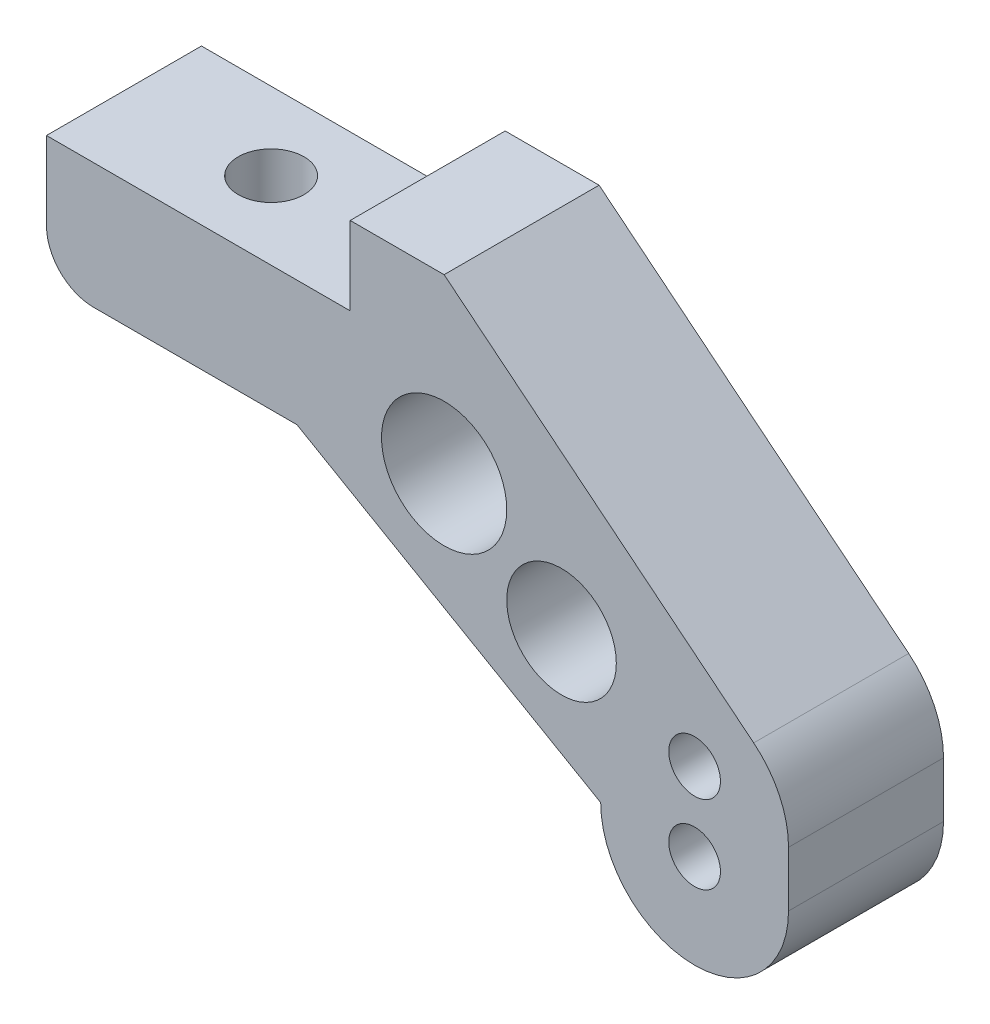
ISO-10303-21;
HEADER;
FILE_DESCRIPTION(('STEP AP214'),'2;1');
FILE_NAME('part.step','',(''),(''),'','','');
FILE_SCHEMA(('AUTOMOTIVE_DESIGN { 1 0 10303 214 1 1 1 1 }'));
ENDSEC;
DATA;
#1=APPLICATION_CONTEXT('core data for automotive mechanical design processes');
#2=APPLICATION_PROTOCOL_DEFINITION('international standard','automotive_design',2000,#1);
#3=PRODUCT_CONTEXT('',#1,'mechanical');
#4=PRODUCT('Part','Part','',(#3));
#5=PRODUCT_RELATED_PRODUCT_CATEGORY('part','',(#4));
#6=PRODUCT_DEFINITION_FORMATION('','',#4);
#7=PRODUCT_DEFINITION_CONTEXT('part definition',#1,'design');
#8=PRODUCT_DEFINITION('design','',#6,#7);
#9=PRODUCT_DEFINITION_SHAPE('','',#8);
#10=(LENGTH_UNIT() NAMED_UNIT(*) SI_UNIT(.MILLI.,.METRE.));
#11=(NAMED_UNIT(*) PLANE_ANGLE_UNIT() SI_UNIT($,.RADIAN.));
#12=(NAMED_UNIT(*) SI_UNIT($,.STERADIAN.) SOLID_ANGLE_UNIT());
#13=UNCERTAINTY_MEASURE_WITH_UNIT(LENGTH_MEASURE(1.E-05),#10,'distance_accuracy_value','');
#14=(GEOMETRIC_REPRESENTATION_CONTEXT(3) GLOBAL_UNCERTAINTY_ASSIGNED_CONTEXT((#13)) GLOBAL_UNIT_ASSIGNED_CONTEXT((#10,
#11,#12)) REPRESENTATION_CONTEXT('',''));
#15=CARTESIAN_POINT('',(0.,0.,0.));
#16=DIRECTION('',(0.,0.,1.));
#17=DIRECTION('',(1.,0.,0.));
#18=AXIS2_PLACEMENT_3D('',#15,#16,#17);
#19=CARTESIAN_POINT('',(-10.,0.,0.));
#20=DIRECTION('',(0.,1.,0.));
#21=DIRECTION('',(0.,0.,1.));
#22=AXIS2_PLACEMENT_3D('',#19,#20,#21);
#23=CYLINDRICAL_SURFACE('',#22,2.1);
#24=CARTESIAN_POINT('',(-10.,0.,0.));
#25=DIRECTION('',(0.,1.,0.));
#26=DIRECTION('',(0.,0.,1.));
#27=AXIS2_PLACEMENT_3D('',#24,#25,#26);
#28=CIRCLE('',#27,2.1);
#29=CARTESIAN_POINT('',(-10.,0.,2.1));
#30=VERTEX_POINT('',#29);
#31=EDGE_CURVE('E114',#30,#30,#28,.F.);
#32=ORIENTED_EDGE('',*,*,#31,.F.);
#33=EDGE_LOOP('',(#32));
#34=FACE_BOUND('',#33,.T.);
#35=CARTESIAN_POINT('',(-10.,-8.,0.));
#36=DIRECTION('',(0.,1.,0.));
#37=DIRECTION('',(0.,0.,1.));
#38=AXIS2_PLACEMENT_3D('',#35,#36,#37);
#39=CIRCLE('',#38,2.1);
#40=CARTESIAN_POINT('',(-10.,-8.,2.1));
#41=VERTEX_POINT('',#40);
#42=EDGE_CURVE('E161',#41,#41,#39,.T.);
#43=ORIENTED_EDGE('',*,*,#42,.F.);
#44=EDGE_LOOP('',(#43));
#45=FACE_BOUND('',#44,.T.);
#46=ADVANCED_FACE('F16',(#34,#45),#23,.F.);
#47=CARTESIAN_POINT('',(0.,0.,-4.95));
#48=DIRECTION('',(0.,0.,1.));
#49=DIRECTION('',(1.,0.,0.));
#50=AXIS2_PLACEMENT_3D('',#47,#48,#49);
#51=PLANE('',#50);
#52=CARTESIAN_POINT('',(6.,-6.,-4.95));
#53=DIRECTION('',(0.,0.,1.));
#54=DIRECTION('',(1.,0.,0.));
#55=AXIS2_PLACEMENT_3D('',#52,#53,#54);
#56=CIRCLE('',#55,4.);
#57=CARTESIAN_POINT('',(10.,-6.,-4.95));
#58=VERTEX_POINT('',#57);
#59=EDGE_CURVE('E187',#58,#58,#56,.T.);
#60=ORIENTED_EDGE('',*,*,#59,.T.);
#61=EDGE_LOOP('',(#60));
#62=FACE_BOUND('',#61,.T.);
#63=CARTESIAN_POINT('',(13.5,-11.,-4.95));
#64=DIRECTION('',(0.,0.,1.));
#65=DIRECTION('',(1.,0.,0.));
#66=AXIS2_PLACEMENT_3D('',#63,#64,#65);
#67=CIRCLE('',#66,3.5);
#68=CARTESIAN_POINT('',(17.,-11.,-4.95));
#69=VERTEX_POINT('',#68);
#70=EDGE_CURVE('E190',#69,#69,#67,.T.);
#71=ORIENTED_EDGE('',*,*,#70,.T.);
#72=EDGE_LOOP('',(#71));
#73=FACE_BOUND('',#72,.T.);
#74=CARTESIAN_POINT('',(22.,-19.20059522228,-4.95));
#75=DIRECTION('',(0.,0.,1.));
#76=DIRECTION('',(1.,0.,0.));
#77=AXIS2_PLACEMENT_3D('',#74,#75,#76);
#78=CIRCLE('',#77,1.65);
#79=CARTESIAN_POINT('',(23.65,-19.20059522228,-4.95));
#80=VERTEX_POINT('',#79);
#81=EDGE_CURVE('E120',#80,#80,#78,.T.);
#82=ORIENTED_EDGE('',*,*,#81,.T.);
#83=EDGE_LOOP('',(#82));
#84=FACE_BOUND('',#83,.T.);
#85=CARTESIAN_POINT('',(22.,-14.20059522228,-4.95));
#86=DIRECTION('',(0.,0.,1.));
#87=DIRECTION('',(1.,0.,0.));
#88=AXIS2_PLACEMENT_3D('',#85,#86,#87);
#89=CIRCLE('',#88,1.65);
#90=CARTESIAN_POINT('',(23.65,-14.20059522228,-4.95));
#91=VERTEX_POINT('',#90);
#92=EDGE_CURVE('E117',#91,#91,#89,.T.);
#93=ORIENTED_EDGE('',*,*,#92,.T.);
#94=EDGE_LOOP('',(#93));
#95=FACE_BOUND('',#94,.T.);
#96=DIRECTION('',(1.,0.,0.));
#97=VECTOR('',#96,1.);
#98=CARTESIAN_POINT('',(6.,5.,-4.95));
#99=LINE('',#98,#97);
#100=CARTESIAN_POINT('',(5.9999999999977,4.99999999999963,-4.95));
#101=VERTEX_POINT('',#100);
#102=CARTESIAN_POINT('',(0.,5.,-4.95));
#103=VERTEX_POINT('',#102);
#104=EDGE_CURVE('E140',#101,#103,#99,.F.);
#105=ORIENTED_EDGE('',*,*,#104,.F.);
#106=DIRECTION('',(-0.777145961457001,0.629320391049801,0.));
#107=VECTOR('',#106,1.);
#108=CARTESIAN_POINT('',(25.7759223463,-11.01422615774,-4.95));
#109=LINE('',#108,#107);
#110=CARTESIAN_POINT('',(25.7759223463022,-11.0142261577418,-4.95));
#111=VERTEX_POINT('',#110);
#112=EDGE_CURVE('E146',#111,#101,#109,.T.);
#113=ORIENTED_EDGE('',*,*,#112,.F.);
#114=CARTESIAN_POINT('',(22.,-15.67710192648,-4.95));
#115=DIRECTION('',(0.,0.,1.));
#116=DIRECTION('',(1.,0.,0.));
#117=AXIS2_PLACEMENT_3D('',#114,#115,#116);
#118=CIRCLE('',#117,6.);
#119=CARTESIAN_POINT('',(28.,-15.67710192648,-4.95));
#120=VERTEX_POINT('',#119);
#121=EDGE_CURVE('E197',#120,#111,#118,.T.);
#122=ORIENTED_EDGE('',*,*,#121,.F.);
#123=DIRECTION('',(0.,1.,0.));
#124=VECTOR('',#123,1.);
#125=CARTESIAN_POINT('',(28.,-19.20059522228,-4.95));
#126=LINE('',#125,#124);
#127=CARTESIAN_POINT('',(28.,-19.20059522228,-4.95));
#128=VERTEX_POINT('',#127);
#129=EDGE_CURVE('E152',#128,#120,#126,.T.);
#130=ORIENTED_EDGE('',*,*,#129,.F.);
#131=CARTESIAN_POINT('',(22.,-19.20059522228,-4.95));
#132=DIRECTION('',(0.,0.,1.));
#133=DIRECTION('',(1.,0.,0.));
#134=AXIS2_PLACEMENT_3D('',#131,#132,#133);
#135=CIRCLE('',#134,6.);
#136=CARTESIAN_POINT('',(16.,-19.2005952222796,-4.95));
#137=VERTEX_POINT('',#136);
#138=EDGE_CURVE('E200',#137,#128,#135,.T.);
#139=ORIENTED_EDGE('',*,*,#138,.F.);
#140=DIRECTION('',(0.866025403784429,-0.500000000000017,0.));
#141=VECTOR('',#140,1.);
#142=CARTESIAN_POINT('',(-3.4,-8.,-4.95));
#143=LINE('',#142,#141);
#144=CARTESIAN_POINT('',(-3.4,-8.,-4.95));
#145=VERTEX_POINT('',#144);
#146=EDGE_CURVE('E157',#145,#137,#143,.T.);
#147=ORIENTED_EDGE('',*,*,#146,.F.);
#148=DIRECTION('',(1.,0.,0.));
#149=VECTOR('',#148,1.);
#150=CARTESIAN_POINT('',(-19.4,-8.,-4.95));
#151=LINE('',#150,#149);
#152=CARTESIAN_POINT('',(-16.4,-8.,-4.95));
#153=VERTEX_POINT('',#152);
#154=EDGE_CURVE('E103',#153,#145,#151,.T.);
#155=ORIENTED_EDGE('',*,*,#154,.F.);
#156=CARTESIAN_POINT('',(-16.4,-5.,-4.95));
#157=DIRECTION('',(0.,0.,-1.));
#158=DIRECTION('',(-1.,0.,0.));
#159=AXIS2_PLACEMENT_3D('',#156,#157,#158);
#160=CIRCLE('',#159,3.);
#161=CARTESIAN_POINT('',(-19.4,-5.,-4.95));
#162=VERTEX_POINT('',#161);
#163=EDGE_CURVE('E20',#162,#153,#160,.F.);
#164=ORIENTED_EDGE('',*,*,#163,.F.);
#165=DIRECTION('',(0.,1.,0.));
#166=VECTOR('',#165,1.);
#167=CARTESIAN_POINT('',(-19.4,0.,-4.95));
#168=LINE('',#167,#166);
#169=CARTESIAN_POINT('',(-19.4,0.,-4.95));
#170=VERTEX_POINT('',#169);
#171=EDGE_CURVE('E101',#170,#162,#168,.F.);
#172=ORIENTED_EDGE('',*,*,#171,.F.);
#173=DIRECTION('',(1.,0.,0.));
#174=VECTOR('',#173,1.);
#175=CARTESIAN_POINT('',(0.,0.,-4.95));
#176=LINE('',#175,#174);
#177=CARTESIAN_POINT('',(0.,0.,-4.95));
#178=VERTEX_POINT('',#177);
#179=EDGE_CURVE('E128',#178,#170,#176,.F.);
#180=ORIENTED_EDGE('',*,*,#179,.F.);
#181=DIRECTION('',(0.,1.,0.));
#182=VECTOR('',#181,1.);
#183=CARTESIAN_POINT('',(0.,5.,-4.95));
#184=LINE('',#183,#182);
#185=EDGE_CURVE('E134',#103,#178,#184,.F.);
#186=ORIENTED_EDGE('',*,*,#185,.F.);
#187=EDGE_LOOP('',(#105,#113,#122,#130,#139,#147,#155,#164,#172,#180,#186));
#188=FACE_BOUND('',#187,.T.);
#189=ADVANCED_FACE('F99',(#62,#73,#84,#95,#188),#51,.F.);
#190=CARTESIAN_POINT('',(-16.4,-5.,17.85564));
#191=DIRECTION('',(0.,0.,-1.));
#192=DIRECTION('',(-1.,0.,0.));
#193=AXIS2_PLACEMENT_3D('',#190,#191,#192);
#194=CYLINDRICAL_SURFACE('',#193,3.);
#195=CARTESIAN_POINT('',(-16.4,-5.,4.95));
#196=DIRECTION('',(0.,0.,-1.));
#197=DIRECTION('',(-1.,0.,0.));
#198=AXIS2_PLACEMENT_3D('',#195,#196,#197);
#199=CIRCLE('',#198,3.);
#200=CARTESIAN_POINT('',(-19.4,-5.,4.95));
#201=VERTEX_POINT('',#200);
#202=CARTESIAN_POINT('',(-16.4,-8.,4.95));
#203=VERTEX_POINT('',#202);
#204=EDGE_CURVE('E111',#201,#203,#199,.F.);
#205=ORIENTED_EDGE('',*,*,#204,.F.);
#206=DIRECTION('',(0.,0.,1.));
#207=VECTOR('',#206,1.);
#208=CARTESIAN_POINT('',(-19.4,-5.,-4.95));
#209=LINE('',#208,#207);
#210=EDGE_CURVE('E108',#162,#201,#209,.T.);
#211=ORIENTED_EDGE('',*,*,#210,.F.);
#212=ORIENTED_EDGE('',*,*,#163,.T.);
#213=DIRECTION('',(0.,0.,-1.));
#214=VECTOR('',#213,1.);
#215=CARTESIAN_POINT('',(-16.4,-8.,-4.95));
#216=LINE('',#215,#214);
#217=EDGE_CURVE('E106',#203,#153,#216,.T.);
#218=ORIENTED_EDGE('',*,*,#217,.F.);
#219=EDGE_LOOP('',(#205,#211,#212,#218));
#220=FACE_BOUND('',#219,.T.);
#221=ADVANCED_FACE('F109',(#220),#194,.T.);
#222=CARTESIAN_POINT('',(-19.4,-8.,-4.95));
#223=DIRECTION('',(0.,-1.,0.));
#224=DIRECTION('',(0.,0.,-1.));
#225=AXIS2_PLACEMENT_3D('',#222,#223,#224);
#226=PLANE('',#225);
#227=ORIENTED_EDGE('',*,*,#42,.T.);
#228=EDGE_LOOP('',(#227));
#229=FACE_BOUND('',#228,.T.);
#230=DIRECTION('',(0.,0.,1.));
#231=VECTOR('',#230,1.);
#232=CARTESIAN_POINT('',(-3.4,-8.,-4.95));
#233=LINE('',#232,#231);
#234=CARTESIAN_POINT('',(-3.4,-8.,4.95));
#235=VERTEX_POINT('',#234);
#236=EDGE_CURVE('E160',#235,#145,#233,.F.);
#237=ORIENTED_EDGE('',*,*,#236,.F.);
#238=DIRECTION('',(1.,0.,0.));
#239=VECTOR('',#238,1.);
#240=CARTESIAN_POINT('',(0.,-8.,4.95));
#241=LINE('',#240,#239);
#242=EDGE_CURVE('E186',#203,#235,#241,.T.);
#243=ORIENTED_EDGE('',*,*,#242,.F.);
#244=ORIENTED_EDGE('',*,*,#217,.T.);
#245=ORIENTED_EDGE('',*,*,#154,.T.);
#246=EDGE_LOOP('',(#237,#243,#244,#245));
#247=FACE_BOUND('',#246,.T.);
#248=ADVANCED_FACE('F205',(#229,#247),#226,.T.);
#249=CARTESIAN_POINT('',(-3.4,-8.,-4.95));
#250=DIRECTION('',(-0.500000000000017,-0.866025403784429,0.));
#251=DIRECTION('',(0.866025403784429,-0.500000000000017,0.));
#252=AXIS2_PLACEMENT_3D('',#249,#250,#251);
#253=PLANE('',#252);
#254=DIRECTION('',(0.866025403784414,-0.500000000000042,0.));
#255=VECTOR('',#254,1.);
#256=CARTESIAN_POINT('',(-3.4,-8.,4.95));
#257=LINE('',#256,#255);
#258=CARTESIAN_POINT('',(16.,-19.20059522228,4.95));
#259=VERTEX_POINT('',#258);
#260=EDGE_CURVE('E184',#235,#259,#257,.T.);
#261=ORIENTED_EDGE('',*,*,#260,.F.);
#262=ORIENTED_EDGE('',*,*,#236,.T.);
#263=ORIENTED_EDGE('',*,*,#146,.T.);
#264=DIRECTION('',(0.,0.,1.));
#265=VECTOR('',#264,1.);
#266=CARTESIAN_POINT('',(16.,-19.20059522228,-4.95));
#267=LINE('',#266,#265);
#268=EDGE_CURVE('E156',#259,#137,#267,.F.);
#269=ORIENTED_EDGE('',*,*,#268,.F.);
#270=EDGE_LOOP('',(#261,#262,#263,#269));
#271=FACE_BOUND('',#270,.T.);
#272=ADVANCED_FACE('F278',(#271),#253,.T.);
#273=CARTESIAN_POINT('',(22.,-19.20059522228,-4.95));
#274=DIRECTION('',(0.,0.,1.));
#275=DIRECTION('',(1.,0.,0.));
#276=AXIS2_PLACEMENT_3D('',#273,#274,#275);
#277=CYLINDRICAL_SURFACE('',#276,6.);
#278=CARTESIAN_POINT('',(22.,-19.20059522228,4.95));
#279=DIRECTION('',(0.,0.,1.));
#280=DIRECTION('',(1.,0.,0.));
#281=AXIS2_PLACEMENT_3D('',#278,#279,#280);
#282=CIRCLE('',#281,6.);
#283=CARTESIAN_POINT('',(28.,-19.20059522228,4.95));
#284=VERTEX_POINT('',#283);
#285=EDGE_CURVE('E181',#259,#284,#282,.T.);
#286=ORIENTED_EDGE('',*,*,#285,.F.);
#287=ORIENTED_EDGE('',*,*,#268,.T.);
#288=ORIENTED_EDGE('',*,*,#138,.T.);
#289=DIRECTION('',(0.,0.,-1.));
#290=VECTOR('',#289,1.);
#291=CARTESIAN_POINT('',(28.,-19.20059522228,-4.95));
#292=LINE('',#291,#290);
#293=EDGE_CURVE('E155',#284,#128,#292,.T.);
#294=ORIENTED_EDGE('',*,*,#293,.F.);
#295=EDGE_LOOP('',(#286,#287,#288,#294));
#296=FACE_BOUND('',#295,.T.);
#297=ADVANCED_FACE('F313',(#296),#277,.T.);
#298=CARTESIAN_POINT('',(28.,-19.20059522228,-4.95));
#299=DIRECTION('',(1.,0.,0.));
#300=DIRECTION('',(0.,0.,-1.));
#301=AXIS2_PLACEMENT_3D('',#298,#299,#300);
#302=PLANE('',#301);
#303=DIRECTION('',(0.,1.,0.));
#304=VECTOR('',#303,1.);
#305=CARTESIAN_POINT('',(28.,0.,4.95));
#306=LINE('',#305,#304);
#307=CARTESIAN_POINT('',(28.,-15.67710192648,4.95));
#308=VERTEX_POINT('',#307);
#309=EDGE_CURVE('E180',#284,#308,#306,.T.);
#310=ORIENTED_EDGE('',*,*,#309,.F.);
#311=ORIENTED_EDGE('',*,*,#293,.T.);
#312=ORIENTED_EDGE('',*,*,#129,.T.);
#313=DIRECTION('',(0.,0.,1.));
#314=VECTOR('',#313,1.);
#315=CARTESIAN_POINT('',(28.,-15.67710192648,-4.95));
#316=LINE('',#315,#314);
#317=EDGE_CURVE('E149',#308,#120,#316,.F.);
#318=ORIENTED_EDGE('',*,*,#317,.F.);
#319=EDGE_LOOP('',(#310,#311,#312,#318));
#320=FACE_BOUND('',#319,.T.);
#321=ADVANCED_FACE('F310',(#320),#302,.T.);
#322=CARTESIAN_POINT('',(22.,-15.67710192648,-4.95));
#323=DIRECTION('',(0.,0.,1.));
#324=DIRECTION('',(1.,0.,0.));
#325=AXIS2_PLACEMENT_3D('',#322,#323,#324);
#326=CYLINDRICAL_SURFACE('',#325,6.);
#327=CARTESIAN_POINT('',(22.,-15.67710192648,4.95));
#328=DIRECTION('',(0.,0.,1.));
#329=DIRECTION('',(1.,0.,0.));
#330=AXIS2_PLACEMENT_3D('',#327,#328,#329);
#331=CIRCLE('',#330,6.);
#332=CARTESIAN_POINT('',(25.7759223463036,-11.0142261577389,4.95));
#333=VERTEX_POINT('',#332);
#334=EDGE_CURVE('E176',#308,#333,#331,.T.);
#335=ORIENTED_EDGE('',*,*,#334,.F.);
#336=ORIENTED_EDGE('',*,*,#317,.T.);
#337=ORIENTED_EDGE('',*,*,#121,.T.);
#338=DIRECTION('',(0.,0.,1.));
#339=VECTOR('',#338,1.);
#340=CARTESIAN_POINT('',(25.775922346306,-11.0142261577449,-4.95));
#341=LINE('',#340,#339);
#342=EDGE_CURVE('E143',#333,#111,#341,.F.);
#343=ORIENTED_EDGE('',*,*,#342,.F.);
#344=EDGE_LOOP('',(#335,#336,#337,#343));
#345=FACE_BOUND('',#344,.T.);
#346=ADVANCED_FACE('F307',(#345),#326,.T.);
#347=CARTESIAN_POINT('',(25.7759223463,-11.01422615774,-4.95));
#348=DIRECTION('',(0.629320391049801,0.777145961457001,0.));
#349=DIRECTION('',(-0.777145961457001,0.629320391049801,0.));
#350=AXIS2_PLACEMENT_3D('',#347,#348,#349);
#351=PLANE('',#350);
#352=DIRECTION('',(-0.77714596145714,0.629320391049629,0.));
#353=VECTOR('',#352,1.);
#354=CARTESIAN_POINT('',(25.77592234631,-11.01422615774,4.95));
#355=LINE('',#354,#353);
#356=CARTESIAN_POINT('',(5.999999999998,4.99999999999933,4.95));
#357=VERTEX_POINT('',#356);
#358=EDGE_CURVE('E179',#333,#357,#355,.T.);
#359=ORIENTED_EDGE('',*,*,#358,.F.);
#360=ORIENTED_EDGE('',*,*,#342,.T.);
#361=ORIENTED_EDGE('',*,*,#112,.T.);
#362=DIRECTION('',(0.,0.,1.));
#363=VECTOR('',#362,1.);
#364=CARTESIAN_POINT('',(5.999999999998,5.,-4.95));
#365=LINE('',#364,#363);
#366=EDGE_CURVE('E137',#357,#101,#365,.F.);
#367=ORIENTED_EDGE('',*,*,#366,.F.);
#368=EDGE_LOOP('',(#359,#360,#361,#367));
#369=FACE_BOUND('',#368,.T.);
#370=ADVANCED_FACE('F300',(#369),#351,.T.);
#371=CARTESIAN_POINT('',(6.,5.,-4.95));
#372=DIRECTION('',(0.,1.,0.));
#373=DIRECTION('',(0.,0.,1.));
#374=AXIS2_PLACEMENT_3D('',#371,#372,#373);
#375=PLANE('',#374);
#376=DIRECTION('',(1.,0.,0.));
#377=VECTOR('',#376,1.);
#378=CARTESIAN_POINT('',(0.,4.999999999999,4.95));
#379=LINE('',#378,#377);
#380=CARTESIAN_POINT('',(0.,4.99999999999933,4.95));
#381=VERTEX_POINT('',#380);
#382=EDGE_CURVE('E243',#357,#381,#379,.F.);
#383=ORIENTED_EDGE('',*,*,#382,.F.);
#384=ORIENTED_EDGE('',*,*,#366,.T.);
#385=ORIENTED_EDGE('',*,*,#104,.T.);
#386=DIRECTION('',(0.,0.,1.));
#387=VECTOR('',#386,1.);
#388=CARTESIAN_POINT('',(0.,5.,-4.95));
#389=LINE('',#388,#387);
#390=EDGE_CURVE('E131',#381,#103,#389,.F.);
#391=ORIENTED_EDGE('',*,*,#390,.F.);
#392=EDGE_LOOP('',(#383,#384,#385,#391));
#393=FACE_BOUND('',#392,.T.);
#394=ADVANCED_FACE('F302',(#393),#375,.T.);
#395=CARTESIAN_POINT('',(0.,5.,-4.95));
#396=DIRECTION('',(-1.,0.,0.));
#397=DIRECTION('',(0.,0.,1.));
#398=AXIS2_PLACEMENT_3D('',#395,#396,#397);
#399=PLANE('',#398);
#400=DIRECTION('',(0.,1.,0.));
#401=VECTOR('',#400,1.);
#402=CARTESIAN_POINT('',(0.,0.,4.95));
#403=LINE('',#402,#401);
#404=CARTESIAN_POINT('',(0.,0.,4.95));
#405=VERTEX_POINT('',#404);
#406=EDGE_CURVE('E239',#381,#405,#403,.F.);
#407=ORIENTED_EDGE('',*,*,#406,.F.);
#408=ORIENTED_EDGE('',*,*,#390,.T.);
#409=ORIENTED_EDGE('',*,*,#185,.T.);
#410=DIRECTION('',(0.,0.,1.));
#411=VECTOR('',#410,1.);
#412=CARTESIAN_POINT('',(0.,0.,-4.95));
#413=LINE('',#412,#411);
#414=EDGE_CURVE('E130',#405,#178,#413,.F.);
#415=ORIENTED_EDGE('',*,*,#414,.F.);
#416=EDGE_LOOP('',(#407,#408,#409,#415));
#417=FACE_BOUND('',#416,.T.);
#418=ADVANCED_FACE('F304',(#417),#399,.T.);
#419=CARTESIAN_POINT('',(0.,0.,-4.95));
#420=DIRECTION('',(0.,1.,0.));
#421=DIRECTION('',(0.,0.,1.));
#422=AXIS2_PLACEMENT_3D('',#419,#420,#421);
#423=PLANE('',#422);
#424=ORIENTED_EDGE('',*,*,#31,.T.);
#425=EDGE_LOOP('',(#424));
#426=FACE_BOUND('',#425,.T.);
#427=DIRECTION('',(1.,0.,0.));
#428=VECTOR('',#427,1.);
#429=CARTESIAN_POINT('',(0.,0.,4.95));
#430=LINE('',#429,#428);
#431=CARTESIAN_POINT('',(-19.4,0.,4.95));
#432=VERTEX_POINT('',#431);
#433=EDGE_CURVE('E236',#405,#432,#430,.F.);
#434=ORIENTED_EDGE('',*,*,#433,.F.);
#435=ORIENTED_EDGE('',*,*,#414,.T.);
#436=ORIENTED_EDGE('',*,*,#179,.T.);
#437=DIRECTION('',(0.,0.,1.));
#438=VECTOR('',#437,1.);
#439=CARTESIAN_POINT('',(-19.4,0.,-4.95));
#440=LINE('',#439,#438);
#441=EDGE_CURVE('E35',#432,#170,#440,.F.);
#442=ORIENTED_EDGE('',*,*,#441,.F.);
#443=EDGE_LOOP('',(#434,#435,#436,#442));
#444=FACE_BOUND('',#443,.T.);
#445=ADVANCED_FACE('F305',(#426,#444),#423,.T.);
#446=CARTESIAN_POINT('',(-19.4,0.,-4.95));
#447=DIRECTION('',(-1.,0.,0.));
#448=DIRECTION('',(0.,0.,1.));
#449=AXIS2_PLACEMENT_3D('',#446,#447,#448);
#450=PLANE('',#449);
#451=ORIENTED_EDGE('',*,*,#441,.T.);
#452=ORIENTED_EDGE('',*,*,#171,.T.);
#453=ORIENTED_EDGE('',*,*,#210,.T.);
#454=DIRECTION('',(0.,1.,0.));
#455=VECTOR('',#454,1.);
#456=CARTESIAN_POINT('',(-19.4,0.,4.95));
#457=LINE('',#456,#455);
#458=EDGE_CURVE('E175',#432,#201,#457,.F.);
#459=ORIENTED_EDGE('',*,*,#458,.F.);
#460=EDGE_LOOP('',(#451,#452,#453,#459));
#461=FACE_BOUND('',#460,.T.);
#462=ADVANCED_FACE('F116',(#461),#450,.T.);
#463=CARTESIAN_POINT('',(22.,-14.20059522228,-5.94));
#464=DIRECTION('',(0.,0.,1.));
#465=DIRECTION('',(1.,0.,0.));
#466=AXIS2_PLACEMENT_3D('',#463,#464,#465);
#467=CYLINDRICAL_SURFACE('',#466,1.65);
#468=CARTESIAN_POINT('',(22.,-14.20059522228,4.95));
#469=DIRECTION('',(0.,0.,1.));
#470=DIRECTION('',(1.,0.,0.));
#471=AXIS2_PLACEMENT_3D('',#468,#469,#470);
#472=CIRCLE('',#471,1.65);
#473=CARTESIAN_POINT('',(23.65,-14.20059522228,4.95));
#474=VERTEX_POINT('',#473);
#475=EDGE_CURVE('E172',#474,#474,#472,.F.);
#476=ORIENTED_EDGE('',*,*,#475,.F.);
#477=EDGE_LOOP('',(#476));
#478=FACE_BOUND('',#477,.T.);
#479=ORIENTED_EDGE('',*,*,#92,.F.);
#480=EDGE_LOOP('',(#479));
#481=FACE_BOUND('',#480,.T.);
#482=ADVANCED_FACE('F337',(#478,#481),#467,.F.);
#483=CARTESIAN_POINT('',(22.,-19.20059522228,-5.94));
#484=DIRECTION('',(0.,0.,1.));
#485=DIRECTION('',(1.,0.,0.));
#486=AXIS2_PLACEMENT_3D('',#483,#484,#485);
#487=CYLINDRICAL_SURFACE('',#486,1.65);
#488=CARTESIAN_POINT('',(22.,-19.20059522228,4.95));
#489=DIRECTION('',(0.,0.,1.));
#490=DIRECTION('',(1.,0.,0.));
#491=AXIS2_PLACEMENT_3D('',#488,#489,#490);
#492=CIRCLE('',#491,1.65);
#493=CARTESIAN_POINT('',(23.65,-19.20059522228,4.95));
#494=VERTEX_POINT('',#493);
#495=EDGE_CURVE('E169',#494,#494,#492,.F.);
#496=ORIENTED_EDGE('',*,*,#495,.F.);
#497=EDGE_LOOP('',(#496));
#498=FACE_BOUND('',#497,.T.);
#499=ORIENTED_EDGE('',*,*,#81,.F.);
#500=EDGE_LOOP('',(#499));
#501=FACE_BOUND('',#500,.T.);
#502=ADVANCED_FACE('F340',(#498,#501),#487,.F.);
#503=CARTESIAN_POINT('',(13.5,-11.,-4.95));
#504=DIRECTION('',(0.,0.,1.));
#505=DIRECTION('',(1.,0.,0.));
#506=AXIS2_PLACEMENT_3D('',#503,#504,#505);
#507=CYLINDRICAL_SURFACE('',#506,3.5);
#508=CARTESIAN_POINT('',(13.5,-11.,4.95));
#509=DIRECTION('',(0.,0.,1.));
#510=DIRECTION('',(1.,0.,0.));
#511=AXIS2_PLACEMENT_3D('',#508,#509,#510);
#512=CIRCLE('',#511,3.5);
#513=CARTESIAN_POINT('',(17.,-11.,4.95));
#514=VERTEX_POINT('',#513);
#515=EDGE_CURVE('E26',#514,#514,#512,.F.);
#516=ORIENTED_EDGE('',*,*,#515,.F.);
#517=EDGE_LOOP('',(#516));
#518=FACE_BOUND('',#517,.T.);
#519=ORIENTED_EDGE('',*,*,#70,.F.);
#520=EDGE_LOOP('',(#519));
#521=FACE_BOUND('',#520,.T.);
#522=ADVANCED_FACE('F224',(#518,#521),#507,.F.);
#523=CARTESIAN_POINT('',(6.,-6.,-4.95));
#524=DIRECTION('',(0.,0.,1.));
#525=DIRECTION('',(1.,0.,0.));
#526=AXIS2_PLACEMENT_3D('',#523,#524,#525);
#527=CYLINDRICAL_SURFACE('',#526,4.);
#528=CARTESIAN_POINT('',(6.,-6.,4.95));
#529=DIRECTION('',(0.,0.,1.));
#530=DIRECTION('',(1.,0.,0.));
#531=AXIS2_PLACEMENT_3D('',#528,#529,#530);
#532=CIRCLE('',#531,4.);
#533=CARTESIAN_POINT('',(10.,-6.,4.95));
#534=VERTEX_POINT('',#533);
#535=EDGE_CURVE('E11',#534,#534,#532,.F.);
#536=ORIENTED_EDGE('',*,*,#535,.F.);
#537=EDGE_LOOP('',(#536));
#538=FACE_BOUND('',#537,.T.);
#539=ORIENTED_EDGE('',*,*,#59,.F.);
#540=EDGE_LOOP('',(#539));
#541=FACE_BOUND('',#540,.T.);
#542=ADVANCED_FACE('F219',(#538,#541),#527,.F.);
#543=CARTESIAN_POINT('',(0.,0.,4.95));
#544=DIRECTION('',(0.,0.,1.));
#545=DIRECTION('',(1.,0.,0.));
#546=AXIS2_PLACEMENT_3D('',#543,#544,#545);
#547=PLANE('',#546);
#548=ORIENTED_EDGE('',*,*,#535,.T.);
#549=EDGE_LOOP('',(#548));
#550=FACE_BOUND('',#549,.T.);
#551=ORIENTED_EDGE('',*,*,#515,.T.);
#552=EDGE_LOOP('',(#551));
#553=FACE_BOUND('',#552,.T.);
#554=ORIENTED_EDGE('',*,*,#495,.T.);
#555=EDGE_LOOP('',(#554));
#556=FACE_BOUND('',#555,.T.);
#557=ORIENTED_EDGE('',*,*,#475,.T.);
#558=EDGE_LOOP('',(#557));
#559=FACE_BOUND('',#558,.T.);
#560=ORIENTED_EDGE('',*,*,#433,.T.);
#561=ORIENTED_EDGE('',*,*,#458,.T.);
#562=ORIENTED_EDGE('',*,*,#204,.T.);
#563=ORIENTED_EDGE('',*,*,#242,.T.);
#564=ORIENTED_EDGE('',*,*,#260,.T.);
#565=ORIENTED_EDGE('',*,*,#285,.T.);
#566=ORIENTED_EDGE('',*,*,#309,.T.);
#567=ORIENTED_EDGE('',*,*,#334,.T.);
#568=ORIENTED_EDGE('',*,*,#358,.T.);
#569=ORIENTED_EDGE('',*,*,#382,.T.);
#570=ORIENTED_EDGE('',*,*,#406,.T.);
#571=EDGE_LOOP('',(#560,#561,#562,#563,#564,#565,#566,#567,#568,#569,#570));
#572=FACE_BOUND('',#571,.T.);
#573=ADVANCED_FACE('F18',(#550,#553,#556,#559,#572),#547,.T.);
#574=CLOSED_SHELL('',(#46,#189,#221,#248,#272,#297,#321,#346,#370,#394,#418,#445,#462,#482,#502,
#522,#542,#573));
#575=MANIFOLD_SOLID_BREP('B1',#574);
#576=ADVANCED_BREP_SHAPE_REPRESENTATION('',(#18,#575),#14);
#577=SHAPE_DEFINITION_REPRESENTATION(#9,#576);
ENDSEC;
END-ISO-10303-21;
